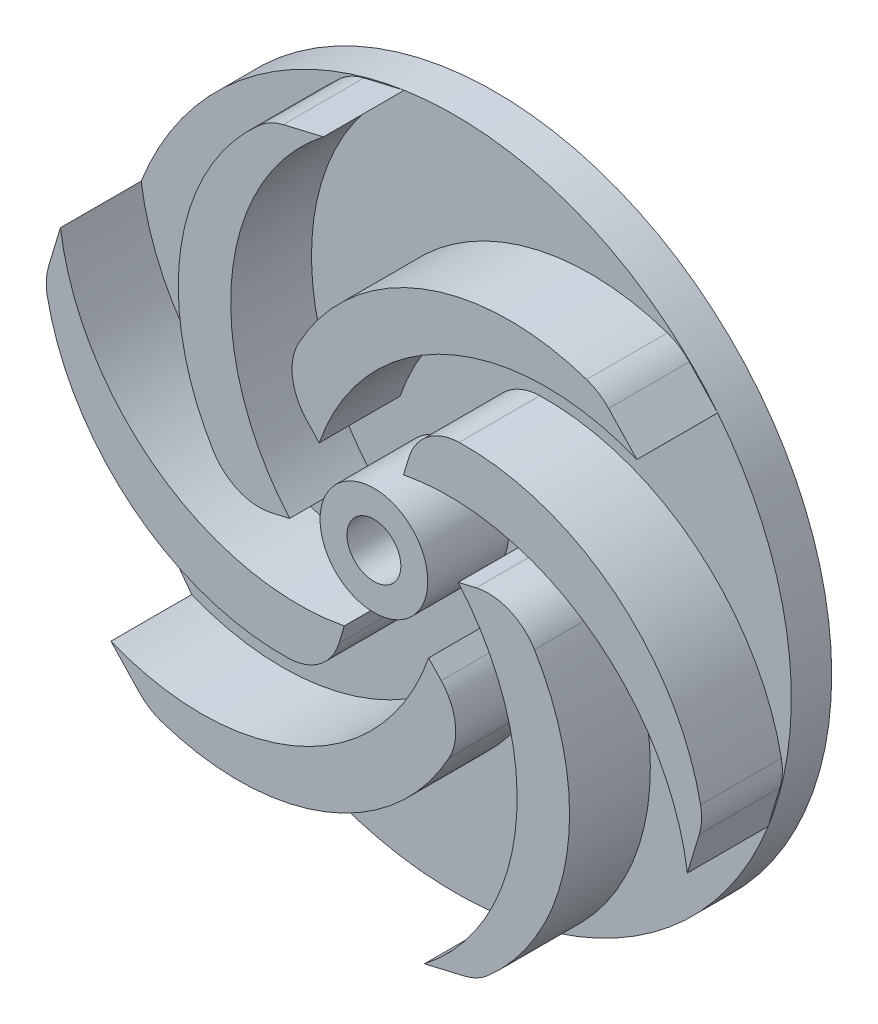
from build123d import *

# Parameters (mm, degrees)
CROQUIS1_R              = 12.5
CROQUIS1_R_2            = 1
SALIENTE_EXTRUIR1_DEPTH = 1.5
CROQUIS2_R              = 2
CROQUIS2_R_2            = 1
SALIENTE_EXTRUIR2_DEPTH = 3
SALIENTE_EXTRUIR3_DEPTH = 3
REDONDEO1_R             = 2


with BuildPart() as part:
    # Croquis1 → Saliente-Extruir1 (new body)
    with BuildSketch(Plane.XY):
        Circle(CROQUIS1_R)
        Circle(CROQUIS1_R_2, mode=Mode.SUBTRACT)
    extrude(amount=SALIENTE_EXTRUIR1_DEPTH)

    # Croquis2 → Saliente-Extruir2 (add)
    with BuildSketch(Plane.XY.offset(1.5)):
        Circle(CROQUIS2_R)
        Circle(CROQUIS2_R_2, mode=Mode.SUBTRACT)
    extrude(amount=SALIENTE_EXTRUIR2_DEPTH)

    # Croquis3 → Saliente-Extruir3 (add)
    with BuildSketch(Plane.XY.offset(1.5)):
        with BuildLine():
            Line((-3.4, 3.9), (-2.030490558, 2.442452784))
            ThreePointArc((-2.030490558, 2.442452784), (2.714499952, 7.659583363), (9.765227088, 7.80322625))
            Line((9.765227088, 7.80322625), (8.395717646, 9.260773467))
            ThreePointArc((8.395717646, 9.260773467), (1.34499051, 9.117130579), (-3.4, 3.9))
        make_face()
        with BuildLine():
            Line((12.217923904, -2.640518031), (11.640405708, -4.555321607))
            ThreePointArc((11.640405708, -4.555321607), (7.990643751, 1.478965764), (1.099980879, 2.979682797))
            Line((1.099980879, 2.979682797), (1.677499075, 4.894486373))
            ThreePointArc((1.677499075, 4.894486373), (8.568161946, 3.39376934), (12.217923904, -2.640518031))
        make_face()
        with BuildLine():
            Line((3.822206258, -11.901291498), (1.87517862, -12.358547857))
            ThreePointArc((1.87517862, -12.358547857), (5.276143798, -6.180617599), (3.130471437, 0.537230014))
            Line((3.130471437, 0.537230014), (5.077499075, 0.994486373))
            ThreePointArc((5.077499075, 0.994486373), (7.223171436, -5.723361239), (3.822206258, -11.901291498))
        make_face()
        with BuildLine():
            Line((-8.395717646, -9.260773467), (-9.765227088, -7.80322625))
            ThreePointArc((-9.765227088, -7.80322625), (-2.714499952, -7.659583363), (2.030490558, -2.442452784))
            Line((2.030490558, -2.442452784), (3.4, -3.9))
            ThreePointArc((3.4, -3.9), (-1.34499051, -9.117130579), (-8.395717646, -9.260773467))
        make_face()
        with BuildLine():
            Line((-12.217923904, 2.640518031), (-11.640405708, 4.555321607))
            ThreePointArc((-11.640405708, 4.555321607), (-7.990643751, -1.478965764), (-1.099980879, -2.979682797))
            Line((-1.099980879, -2.979682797), (-1.677499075, -4.894486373))
            ThreePointArc((-1.677499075, -4.894486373), (-8.568161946, -3.39376934), (-12.217923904, 2.640518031))
        make_face()
        with BuildLine():
            Line((-3.822206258, 11.901291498), (-1.87517862, 12.358547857))
            ThreePointArc((-1.87517862, 12.358547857), (-5.276143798, 6.180617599), (-3.130471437, -0.537230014))
            Line((-3.130471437, -0.537230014), (-5.077499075, -0.994486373))
            ThreePointArc((-5.077499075, -0.994486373), (-7.223171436, 5.723361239), (-3.822206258, 11.901291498))
        make_face()
    extrude(amount=SALIENTE_EXTRUIR3_DEPTH)

    # Redondeo1
    redondeo1_edges = [part.edges().sort_by_distance(p)[0] for p in [
        (8.395717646, 9.260773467, 3),
        (-3.4, 3.9, 3),
        (12.217923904, -2.640518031, 3),
        (1.677499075, 4.894486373, 3),
        (3.822206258, -11.901291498, 3),
        (5.077499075, 0.994486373, 3),
        (-8.395717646, -9.260773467, 3),
        (3.4, -3.9, 3),
        (-12.217923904, 2.640518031, 3),
        (-1.677499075, -4.894486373, 3),
        (-3.822206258, 11.901291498, 3),
        (-5.077499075, -0.994486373, 3),
    ]]
    fillet(redondeo1_edges, radius=REDONDEO1_R)


solid = part.part
